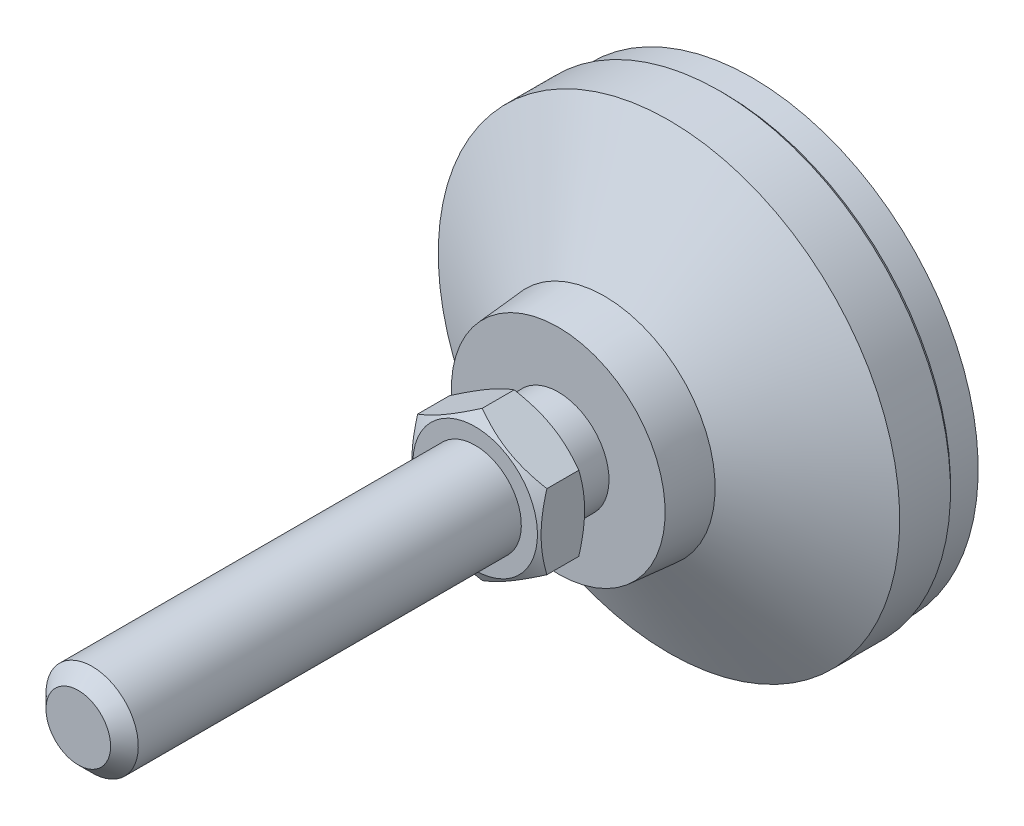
ISO-10303-21;
HEADER;
FILE_DESCRIPTION(('STEP AP214'),'2;1');
FILE_NAME('part.step','',(''),(''),'','','');
FILE_SCHEMA(('AUTOMOTIVE_DESIGN { 1 0 10303 214 1 1 1 1 }'));
ENDSEC;
DATA;
#1=APPLICATION_CONTEXT('core data for automotive mechanical design processes');
#2=APPLICATION_PROTOCOL_DEFINITION('international standard','automotive_design',2000,#1);
#3=PRODUCT_CONTEXT('',#1,'mechanical');
#4=PRODUCT('Part','Part','',(#3));
#5=PRODUCT_RELATED_PRODUCT_CATEGORY('part','',(#4));
#6=PRODUCT_DEFINITION_FORMATION('','',#4);
#7=PRODUCT_DEFINITION_CONTEXT('part definition',#1,'design');
#8=PRODUCT_DEFINITION('design','',#6,#7);
#9=PRODUCT_DEFINITION_SHAPE('','',#8);
#10=(LENGTH_UNIT() NAMED_UNIT(*) SI_UNIT(.MILLI.,.METRE.));
#11=(NAMED_UNIT(*) PLANE_ANGLE_UNIT() SI_UNIT($,.RADIAN.));
#12=(NAMED_UNIT(*) SI_UNIT($,.STERADIAN.) SOLID_ANGLE_UNIT());
#13=UNCERTAINTY_MEASURE_WITH_UNIT(LENGTH_MEASURE(1.E-05),#10,'distance_accuracy_value','');
#14=(GEOMETRIC_REPRESENTATION_CONTEXT(3) GLOBAL_UNCERTAINTY_ASSIGNED_CONTEXT((#13)) GLOBAL_UNIT_ASSIGNED_CONTEXT((#10,
#11,#12)) REPRESENTATION_CONTEXT('',''));
#15=CARTESIAN_POINT('',(0.,0.,0.));
#16=DIRECTION('',(0.,0.,1.));
#17=DIRECTION('',(1.,0.,0.));
#18=AXIS2_PLACEMENT_3D('',#15,#16,#17);
#19=CARTESIAN_POINT('',(0.,0.,2.));
#20=DIRECTION('',(0.,0.,-1.));
#21=DIRECTION('',(0.,1.,0.));
#22=AXIS2_PLACEMENT_3D('',#19,#20,#21);
#23=CYLINDRICAL_SURFACE('',#22,5.50000000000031);
#24=CARTESIAN_POINT('',(0.,0.,25.));
#25=DIRECTION('',(0.,0.,-1.));
#26=DIRECTION('',(0.,1.,0.));
#27=AXIS2_PLACEMENT_3D('',#24,#25,#26);
#28=CIRCLE('',#27,5.50000000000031);
#29=CARTESIAN_POINT('',(0.,5.50000000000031,25.));
#30=VERTEX_POINT('',#29);
#31=EDGE_CURVE('E106',#30,#30,#28,.T.);
#32=ORIENTED_EDGE('',*,*,#31,.T.);
#33=EDGE_LOOP('',(#32));
#34=FACE_BOUND('',#33,.T.);
#35=CARTESIAN_POINT('',(0.,0.,21.));
#36=DIRECTION('',(0.,0.,-1.));
#37=DIRECTION('',(0.,1.,0.));
#38=AXIS2_PLACEMENT_3D('',#35,#36,#37);
#39=CIRCLE('',#38,5.50000000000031);
#40=CARTESIAN_POINT('',(0.,5.50000000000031,21.));
#41=VERTEX_POINT('',#40);
#42=EDGE_CURVE('E93',#41,#41,#39,.T.);
#43=ORIENTED_EDGE('',*,*,#42,.F.);
#44=EDGE_LOOP('',(#43));
#45=FACE_BOUND('',#44,.T.);
#46=ADVANCED_FACE('F14',(#34,#45),#23,.T.);
#47=CARTESIAN_POINT('',(-5.50000000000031,0.,25.));
#48=DIRECTION('',(0.,0.,1.));
#49=DIRECTION('',(0.,-1.,0.));
#50=AXIS2_PLACEMENT_3D('',#47,#48,#49);
#51=PLANE('',#50);
#52=CARTESIAN_POINT('',(0.,0.,25.));
#53=DIRECTION('',(0.,0.,1.));
#54=DIRECTION('',(0.,-1.,0.));
#55=AXIS2_PLACEMENT_3D('',#52,#53,#54);
#56=CIRCLE('',#55,6.75);
#57=CARTESIAN_POINT('',(0.,-6.75,25.));
#58=VERTEX_POINT('',#57);
#59=EDGE_CURVE('E290',#58,#58,#56,.T.);
#60=ORIENTED_EDGE('',*,*,#59,.F.);
#61=EDGE_LOOP('',(#60));
#62=FACE_BOUND('',#61,.T.);
#63=ORIENTED_EDGE('',*,*,#31,.F.);
#64=EDGE_LOOP('',(#63));
#65=FACE_BOUND('',#64,.T.);
#66=ADVANCED_FACE('F148',(#62,#65),#51,.F.);
#67=CARTESIAN_POINT('',(0.,5.50000000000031,21.));
#68=DIRECTION('',(0.,0.,-1.));
#69=DIRECTION('',(0.,1.,0.));
#70=AXIS2_PLACEMENT_3D('',#67,#68,#69);
#71=PLANE('',#70);
#72=ORIENTED_EDGE('',*,*,#42,.T.);
#73=EDGE_LOOP('',(#72));
#74=FACE_BOUND('',#73,.T.);
#75=CARTESIAN_POINT('',(0.,0.,21.));
#76=DIRECTION('',(0.,0.,-1.));
#77=DIRECTION('',(0.,1.,0.));
#78=AXIS2_PLACEMENT_3D('',#75,#76,#77);
#79=CIRCLE('',#78,11.5833333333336);
#80=CARTESIAN_POINT('',(0.,11.5833333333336,21.));
#81=VERTEX_POINT('',#80);
#82=EDGE_CURVE('E88',#81,#81,#79,.T.);
#83=ORIENTED_EDGE('',*,*,#82,.F.);
#84=EDGE_LOOP('',(#83));
#85=FACE_BOUND('',#84,.T.);
#86=ADVANCED_FACE('F131',(#74,#85),#71,.F.);
#87=CARTESIAN_POINT('',(0.,0.,2.));
#88=DIRECTION('',(0.,0.,-1.));
#89=DIRECTION('',(0.,1.,0.));
#90=AXIS2_PLACEMENT_3D('',#87,#88,#89);
#91=CYLINDRICAL_SURFACE('',#90,25.);
#92=CARTESIAN_POINT('',(0.,0.,3.5));
#93=DIRECTION('',(0.,0.,1.));
#94=DIRECTION('',(0.,-1.,0.));
#95=AXIS2_PLACEMENT_3D('',#92,#93,#94);
#96=CIRCLE('',#95,25.);
#97=CARTESIAN_POINT('',(0.,-25.,3.5));
#98=VERTEX_POINT('',#97);
#99=EDGE_CURVE('E114',#98,#98,#96,.T.);
#100=ORIENTED_EDGE('',*,*,#99,.T.);
#101=EDGE_LOOP('',(#100));
#102=FACE_BOUND('',#101,.T.);
#103=CARTESIAN_POINT('',(0.,0.,9.));
#104=DIRECTION('',(0.,0.,-1.));
#105=DIRECTION('',(0.,1.,0.));
#106=AXIS2_PLACEMENT_3D('',#103,#104,#105);
#107=CIRCLE('',#106,25.);
#108=CARTESIAN_POINT('',(0.,25.,9.));
#109=VERTEX_POINT('',#108);
#110=EDGE_CURVE('E112',#109,#109,#107,.T.);
#111=ORIENTED_EDGE('',*,*,#110,.T.);
#112=EDGE_LOOP('',(#111));
#113=FACE_BOUND('',#112,.T.);
#114=ADVANCED_FACE('F127',(#102,#113),#91,.T.);
#115=CARTESIAN_POINT('',(0.,0.,16.));
#116=DIRECTION('',(0.,0.,-1.));
#117=DIRECTION('',(0.,1.,0.));
#118=AXIS2_PLACEMENT_3D('',#115,#116,#117);
#119=CONICAL_SURFACE('',#118,12.0000000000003,1.07685495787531);
#120=ORIENTED_EDGE('',*,*,#110,.F.);
#121=EDGE_LOOP('',(#120));
#122=FACE_BOUND('',#121,.T.);
#123=CARTESIAN_POINT('',(0.,0.,16.));
#124=DIRECTION('',(0.,0.,-1.));
#125=DIRECTION('',(0.,1.,0.));
#126=AXIS2_PLACEMENT_3D('',#123,#124,#125);
#127=CIRCLE('',#126,12.0000000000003);
#128=CARTESIAN_POINT('',(0.,12.0000000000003,16.));
#129=VERTEX_POINT('',#128);
#130=EDGE_CURVE('E109',#129,#129,#127,.T.);
#131=ORIENTED_EDGE('',*,*,#130,.T.);
#132=EDGE_LOOP('',(#131));
#133=FACE_BOUND('',#132,.T.);
#134=ADVANCED_FACE('F130',(#122,#133),#119,.T.);
#135=CARTESIAN_POINT('',(0.,0.,22.));
#136=DIRECTION('',(0.,0.,-1.));
#137=DIRECTION('',(0.,1.,0.));
#138=AXIS2_PLACEMENT_3D('',#135,#136,#137);
#139=CONICAL_SURFACE('',#138,11.5000000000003,0.0831412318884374);
#140=ORIENTED_EDGE('',*,*,#82,.T.);
#141=EDGE_LOOP('',(#140));
#142=FACE_BOUND('',#141,.T.);
#143=ORIENTED_EDGE('',*,*,#130,.F.);
#144=EDGE_LOOP('',(#143));
#145=FACE_BOUND('',#144,.T.);
#146=ADVANCED_FACE('F124',(#142,#145),#139,.T.);
#147=CARTESIAN_POINT('',(0.,0.,3.5));
#148=DIRECTION('',(0.,0.,1.));
#149=DIRECTION('',(0.,-1.,0.));
#150=AXIS2_PLACEMENT_3D('',#147,#148,#149);
#151=CONICAL_SURFACE('',#150,25.,0.785398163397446);
#152=CARTESIAN_POINT('',(0.,0.,3.));
#153=DIRECTION('',(0.,0.,1.));
#154=DIRECTION('',(0.,-1.,0.));
#155=AXIS2_PLACEMENT_3D('',#152,#153,#154);
#156=CIRCLE('',#155,24.5);
#157=CARTESIAN_POINT('',(0.,-24.5,3.));
#158=VERTEX_POINT('',#157);
#159=EDGE_CURVE('E28',#158,#158,#156,.F.);
#160=ORIENTED_EDGE('',*,*,#159,.F.);
#161=EDGE_LOOP('',(#160));
#162=FACE_BOUND('',#161,.T.);
#163=ORIENTED_EDGE('',*,*,#99,.F.);
#164=EDGE_LOOP('',(#163));
#165=FACE_BOUND('',#164,.T.);
#166=ADVANCED_FACE('F16',(#162,#165),#151,.T.);
#167=CARTESIAN_POINT('',(0.,0.,0.));
#168=DIRECTION('',(0.,0.,1.));
#169=DIRECTION('',(0.,-1.,0.));
#170=AXIS2_PLACEMENT_3D('',#167,#168,#169);
#171=CYLINDRICAL_SURFACE('',#170,24.5);
#172=CARTESIAN_POINT('',(0.,0.,0.));
#173=DIRECTION('',(0.,0.,-1.));
#174=DIRECTION('',(0.,1.,0.));
#175=AXIS2_PLACEMENT_3D('',#172,#173,#174);
#176=CIRCLE('',#175,24.5);
#177=CARTESIAN_POINT('',(0.,24.5,0.));
#178=VERTEX_POINT('',#177);
#179=EDGE_CURVE('E263',#178,#178,#176,.T.);
#180=ORIENTED_EDGE('',*,*,#179,.F.);
#181=EDGE_LOOP('',(#180));
#182=FACE_BOUND('',#181,.T.);
#183=ORIENTED_EDGE('',*,*,#159,.T.);
#184=EDGE_LOOP('',(#183));
#185=FACE_BOUND('',#184,.T.);
#186=ADVANCED_FACE('F120',(#182,#185),#171,.T.);
#187=CARTESIAN_POINT('',(0.,0.,0.));
#188=DIRECTION('',(0.,0.,-1.));
#189=DIRECTION('',(0.,1.,0.));
#190=AXIS2_PLACEMENT_3D('',#187,#188,#189);
#191=PLANE('',#190);
#192=ORIENTED_EDGE('',*,*,#179,.T.);
#193=EDGE_LOOP('',(#192));
#194=FACE_BOUND('',#193,.T.);
#195=ADVANCED_FACE('F205',(#194),#191,.T.);
#196=CARTESIAN_POINT('',(0.,0.,25.));
#197=DIRECTION('',(0.,0.,1.));
#198=DIRECTION('',(0.,-1.,0.));
#199=AXIS2_PLACEMENT_3D('',#196,#197,#198);
#200=CONICAL_SURFACE('',#199,6.75,1.0471975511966);
#201=CARTESIAN_POINT('',(0.000200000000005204,-8.08301923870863,25.7696190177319));
#202=CARTESIAN_POINT('',(-0.15366790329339,-7.99418356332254,25.7183374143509));
#203=CARTESIAN_POINT('',(-0.30810950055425,-7.90501666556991,25.669383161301));
#204=CARTESIAN_POINT('',(-0.618246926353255,-7.72595873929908,25.5767703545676));
#205=CARTESIAN_POINT('',(-0.773943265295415,-7.63606741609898,25.5331140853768));
#206=CARTESIAN_POINT('',(-1.24352516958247,-7.36495417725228,25.4109491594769));
#207=CARTESIAN_POINT('',(-1.5592643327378,-7.18266208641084,25.3414631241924));
#208=CARTESIAN_POINT('',(-2.03176224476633,-6.90986528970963,25.2599825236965));
#209=CARTESIAN_POINT('',(-2.18710922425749,-6.82017566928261,25.2367710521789));
#210=CARTESIAN_POINT('',(-2.49850511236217,-6.64039116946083,25.1978487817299));
#211=CARTESIAN_POINT('',(-2.65455395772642,-6.55029632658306,25.1821373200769));
#212=CARTESIAN_POINT('',(-2.96692267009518,-6.36995016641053,25.1586154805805));
#213=CARTESIAN_POINT('',(-3.12324202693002,-6.27969914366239,25.1507961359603));
#214=CARTESIAN_POINT('',(-3.43601650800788,-6.09911871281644,25.1432178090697));
#215=CARTESIAN_POINT('',(-3.59247162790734,-6.00878930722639,25.1434585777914));
#216=CARTESIAN_POINT('',(-4.02110687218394,-5.76131663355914,25.155197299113));
#217=CARTESIAN_POINT('',(-4.2931466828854,-5.60425437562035,25.1749033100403));
#218=CARTESIAN_POINT('',(-4.8354194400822,-5.29117305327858,25.2373910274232));
#219=CARTESIAN_POINT('',(-5.10565047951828,-5.13515508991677,25.2801940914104));
#220=CARTESIAN_POINT('',(-5.64901454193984,-4.82144370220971,25.3871892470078));
#221=CARTESIAN_POINT('',(-5.92207900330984,-4.66378986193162,25.4518346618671));
#222=CARTESIAN_POINT('',(-6.46413578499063,-4.35083323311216,25.5985536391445));
#223=CARTESIAN_POINT('',(-6.73313504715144,-4.1955264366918,25.680592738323));
#224=CARTESIAN_POINT('',(-7.0002,-4.04133641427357,25.7696190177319));
#225=B_SPLINE_CURVE_WITH_KNOTS('',3,(#201,#202,#203,#204,#205,#206,#207,#208,#209,#210,#211,
#212,#213,#214,#215,#216,#217,#218,#219,#220,#221,#222,#223,#224),.UNSPECIFIED.,.F.,.F.,(4,2,2,
2,2,2,2,2,2,2,2,4),(0.,0.554727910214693,1.10969417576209,2.2219327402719,2.76443041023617,
3.30688013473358,3.84871284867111,4.3905288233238,5.33376515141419,6.27787517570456,
7.2429241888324,8.20607866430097),.UNSPECIFIED.);
#226=CARTESIAN_POINT('',(0.,-8.08290376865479,25.7695523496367));
#227=VERTEX_POINT('',#226);
#228=CARTESIAN_POINT('',(-7.,-4.04145188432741,25.7695523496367));
#229=VERTEX_POINT('',#228);
#230=EDGE_CURVE('E73',#227,#229,#225,.T.);
#231=ORIENTED_EDGE('',*,*,#230,.T.);
#232=CARTESIAN_POINT('',(-7.,10.8542758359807,28.5597684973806));
#233=CARTESIAN_POINT('',(-7.,10.5485521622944,28.4114713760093));
#234=CARTESIAN_POINT('',(-7.,10.2421265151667,28.2645966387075));
#235=CARTESIAN_POINT('',(-7.,9.62749794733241,27.974491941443));
#236=CARTESIAN_POINT('',(-7.,9.31929475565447,27.8312625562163));
#237=CARTESIAN_POINT('',(-7.,8.69914909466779,27.5485276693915));
#238=CARTESIAN_POINT('',(-7.,8.38719540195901,27.4090466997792));
#239=CARTESIAN_POINT('',(-7.,7.7608063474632,27.1357948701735));
#240=CARTESIAN_POINT('',(-7.,7.44637110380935,27.0020237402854));
#241=CARTESIAN_POINT('',(-7.,6.80437652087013,26.7375205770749));
#242=CARTESIAN_POINT('',(-7.,6.47671975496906,26.6070237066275));
#243=CARTESIAN_POINT('',(-7.,5.8175730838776,26.3559101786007));
#244=CARTESIAN_POINT('',(-7.,5.48608275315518,26.2352946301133));
#245=CARTESIAN_POINT('',(-7.,4.81935849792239,26.0071116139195));
#246=CARTESIAN_POINT('',(-7.,4.48413371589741,25.8995177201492));
#247=CARTESIAN_POINT('',(-7.,3.80888756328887,25.7008301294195));
#248=CARTESIAN_POINT('',(-7.,3.46886774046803,25.609731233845));
#249=CARTESIAN_POINT('',(-7.,2.78566834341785,25.4488968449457));
#250=CARTESIAN_POINT('',(-7.,2.44251677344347,25.379045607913));
#251=CARTESIAN_POINT('',(-7.,1.92466579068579,25.2932294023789));
#252=CARTESIAN_POINT('',(-7.,1.75151547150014,25.2677829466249));
#253=CARTESIAN_POINT('',(-7.,1.40435470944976,25.2237094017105));
#254=CARTESIAN_POINT('',(-7.,1.23034435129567,25.2050816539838));
#255=CARTESIAN_POINT('',(-7.,0.883969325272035,25.1752501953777));
#256=CARTESIAN_POINT('',(-7.,0.711612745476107,25.1639529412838));
#257=CARTESIAN_POINT('',(-7.,0.366576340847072,25.1486569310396));
#258=CARTESIAN_POINT('',(-7.,0.193896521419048,25.144658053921));
#259=CARTESIAN_POINT('',(-7.,-0.151477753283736,25.1440541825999));
#260=CARTESIAN_POINT('',(-7.,-0.324172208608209,25.1474492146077));
#261=CARTESIAN_POINT('',(-7.,-0.669264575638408,25.1615502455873));
#262=CARTESIAN_POINT('',(-7.,-0.841662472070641,25.1722566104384));
#263=CARTESIAN_POINT('',(-7.,-1.25603087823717,25.2065503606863));
#264=CARTESIAN_POINT('',(-7.,-1.49772013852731,25.2336091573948));
#265=CARTESIAN_POINT('',(-7.,-1.97929249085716,25.3006197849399));
#266=CARTESIAN_POINT('',(-7.,-2.21917533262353,25.3405733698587));
#267=CARTESIAN_POINT('',(-7.,-2.93584677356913,25.4776567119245));
#268=CARTESIAN_POINT('',(-7.,-3.4093887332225,25.5919838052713));
#269=CARTESIAN_POINT('',(-7.,-4.11746158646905,25.7900867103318));
#270=CARTESIAN_POINT('',(-7.,-4.35566892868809,25.861476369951));
#271=CARTESIAN_POINT('',(-7.,-4.82976970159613,26.0116331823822));
#272=CARTESIAN_POINT('',(-7.,-5.06566311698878,26.0904003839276));
#273=CARTESIAN_POINT('',(-7.,-5.53521098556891,26.2540515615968));
#274=CARTESIAN_POINT('',(-7.,-5.76886615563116,26.3389334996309));
#275=CARTESIAN_POINT('',(-7.,-6.23424304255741,26.513819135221));
#276=CARTESIAN_POINT('',(-7.,-6.46596478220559,26.6038227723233));
#277=CARTESIAN_POINT('',(-7.,-7.01339528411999,26.8223061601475));
#278=CARTESIAN_POINT('',(-7.,-7.32835193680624,26.9526669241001));
#279=CARTESIAN_POINT('',(-7.,-7.95558350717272,27.2197063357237));
#280=CARTESIAN_POINT('',(-7.,-8.26785825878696,27.3563853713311));
#281=CARTESIAN_POINT('',(-7.,-8.89022045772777,27.6347899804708));
#282=CARTESIAN_POINT('',(-7.,-9.20030744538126,27.7765165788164));
#283=CARTESIAN_POINT('',(-7.,-9.818608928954,28.0640042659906));
#284=CARTESIAN_POINT('',(-7.,-10.1268233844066,28.2097654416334));
#285=CARTESIAN_POINT('',(-7.,-10.7420114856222,28.5047190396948));
#286=CARTESIAN_POINT('',(-7.,-11.0489834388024,28.6539149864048));
#287=CARTESIAN_POINT('',(-7.,-11.6616035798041,28.9550028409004));
#288=CARTESIAN_POINT('',(-7.,-11.9672517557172,29.1068947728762));
#289=CARTESIAN_POINT('',(-7.,-12.8824454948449,29.565855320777));
#290=CARTESIAN_POINT('',(-7.,-13.4903234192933,29.8762488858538));
#291=CARTESIAN_POINT('',(-7.,-14.6518364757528,30.4768875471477));
#292=CARTESIAN_POINT('',(-7.,-15.2057323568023,30.7666306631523));
#293=CARTESIAN_POINT('',(-7.,-16.3114681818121,31.3500583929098));
#294=CARTESIAN_POINT('',(-7.,-16.8633080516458,31.6437431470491));
#295=CARTESIAN_POINT('',(-7.,-17.9640037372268,32.2333737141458));
#296=CARTESIAN_POINT('',(-7.,-18.5128635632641,32.5293120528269));
#297=CARTESIAN_POINT('',(-7.,-19.6092692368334,33.1235416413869));
#298=CARTESIAN_POINT('',(-7.,-20.156815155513,33.4218327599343));
#299=CARTESIAN_POINT('',(-7.,-20.7038777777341,33.7210016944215));
#300=B_SPLINE_CURVE_WITH_KNOTS('',3,(#232,#233,#234,#235,#236,#237,#238,#239,#240,#241,#242,
#243,#244,#245,#246,#247,#248,#249,#250,#251,#252,#253,#254,#255,#256,#257,#258,#259,#260,#261,
#262,#263,#264,#265,#266,#267,#268,#269,#270,#271,#272,#273,#274,#275,#276,#277,#278,#279,#280,
#281,#282,#283,#284,#285,#286,#287,#288,#289,#290,#291,#292,#293,#294,#295,#296,#297,#298,#299),
.UNSPECIFIED.,.F.,.F.,(4,2,2,2,2,2,2,2,2,2,2,2,2,2,2,2,2,2,2,2,2,2,2,2,2,2,2,2,2,2,2,2,2,4),(0.,
1.01939020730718,2.03894015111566,3.06404327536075,4.08909789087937,5.14703636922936,
6.20509342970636,7.26096593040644,8.31650507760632,9.36618686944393,9.89110420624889,
10.4159708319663,10.9340006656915,11.4520219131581,11.9700449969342,12.488094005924,
13.217279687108,13.9465646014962,15.4059429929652,16.1519059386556,16.8978738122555,
17.6435941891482,18.3893057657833,19.4118194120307,20.4343959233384,21.4571812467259,
22.4799885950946,23.503896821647,24.5278142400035,26.5753720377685,28.4506592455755,
30.326013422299,32.1966862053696,34.0672552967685),.UNSPECIFIED.);
#301=CARTESIAN_POINT('',(-7.,4.04145188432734,25.7695523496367));
#302=VERTEX_POINT('',#301);
#303=EDGE_CURVE('E81',#229,#302,#300,.F.);
#304=ORIENTED_EDGE('',*,*,#303,.T.);
#305=CARTESIAN_POINT('',(-7.0002,4.0413364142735,25.7696190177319));
#306=CARTESIAN_POINT('',(-6.84633209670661,4.13017208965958,25.7183374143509));
#307=CARTESIAN_POINT('',(-6.69189049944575,4.21933898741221,25.669383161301));
#308=CARTESIAN_POINT('',(-6.38175307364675,4.39839691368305,25.5767703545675));
#309=CARTESIAN_POINT('',(-6.22605673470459,4.48828823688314,25.5331140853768));
#310=CARTESIAN_POINT('',(-5.75647483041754,4.75940147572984,25.4109491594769));
#311=CARTESIAN_POINT('',(-5.44073566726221,4.94169356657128,25.3414631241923));
#312=CARTESIAN_POINT('',(-4.96823775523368,5.21449036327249,25.2599825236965));
#313=CARTESIAN_POINT('',(-4.81289077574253,5.3041799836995,25.2367710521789));
#314=CARTESIAN_POINT('',(-4.50149488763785,5.48396448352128,25.1978487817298));
#315=CARTESIAN_POINT('',(-4.34544604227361,5.57405932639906,25.1821373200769));
#316=CARTESIAN_POINT('',(-4.03307732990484,5.75440548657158,25.1586154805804));
#317=CARTESIAN_POINT('',(-3.87675797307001,5.84465650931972,25.1507961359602));
#318=CARTESIAN_POINT('',(-3.56398349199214,6.02523694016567,25.1432178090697));
#319=CARTESIAN_POINT('',(-3.40752837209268,6.11556634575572,25.1434585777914));
#320=CARTESIAN_POINT('',(-2.97889312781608,6.36303901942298,25.155197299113));
#321=CARTESIAN_POINT('',(-2.70685331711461,6.52010127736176,25.1749033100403));
#322=CARTESIAN_POINT('',(-2.16458055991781,6.83318259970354,25.2373910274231));
#323=CARTESIAN_POINT('',(-1.89434952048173,6.98920056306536,25.2801940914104));
#324=CARTESIAN_POINT('',(-1.35098545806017,7.30291195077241,25.3871892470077));
#325=CARTESIAN_POINT('',(-1.07792099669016,7.4605657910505,25.451834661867));
#326=CARTESIAN_POINT('',(-0.535864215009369,7.77352241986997,25.5985536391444));
#327=CARTESIAN_POINT('',(-0.266864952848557,7.92882921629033,25.680592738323));
#328=CARTESIAN_POINT('',(0.000200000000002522,8.08301923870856,25.7696190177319));
#329=B_SPLINE_CURVE_WITH_KNOTS('',3,(#305,#306,#307,#308,#309,#310,#311,#312,#313,#314,#315,
#316,#317,#318,#319,#320,#321,#322,#323,#324,#325,#326,#327,#328),.UNSPECIFIED.,.F.,.F.,(4,2,2,
2,2,2,2,2,2,2,2,4),(0.,0.554727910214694,1.10969417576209,2.22193274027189,2.76443041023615,
3.30688013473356,3.84871284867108,4.39052882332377,5.33376515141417,6.27787517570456,
7.2429241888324,8.20607866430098),.UNSPECIFIED.);
#330=CARTESIAN_POINT('',(0.,8.08290376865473,25.7695523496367));
#331=VERTEX_POINT('',#330);
#332=EDGE_CURVE('E226',#302,#331,#329,.T.);
#333=ORIENTED_EDGE('',*,*,#332,.T.);
#334=CARTESIAN_POINT('',(-0.000199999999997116,8.08301923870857,25.7696190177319));
#335=CARTESIAN_POINT('',(0.153667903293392,7.99418356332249,25.7183374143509));
#336=CARTESIAN_POINT('',(0.308109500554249,7.90501666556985,25.669383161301));
#337=CARTESIAN_POINT('',(0.618246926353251,7.72595873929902,25.5767703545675));
#338=CARTESIAN_POINT('',(0.773943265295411,7.63606741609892,25.5331140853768));
#339=CARTESIAN_POINT('',(1.24352516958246,7.36495417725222,25.4109491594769));
#340=CARTESIAN_POINT('',(1.55926433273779,7.18266208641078,25.3414631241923));
#341=CARTESIAN_POINT('',(2.03176224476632,6.90986528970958,25.2599825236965));
#342=CARTESIAN_POINT('',(2.18710922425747,6.82017566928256,25.2367710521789));
#343=CARTESIAN_POINT('',(2.49850511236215,6.64039116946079,25.1978487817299));
#344=CARTESIAN_POINT('',(2.65455395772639,6.55029632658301,25.1821373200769));
#345=CARTESIAN_POINT('',(2.96692267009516,6.36995016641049,25.1586154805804));
#346=CARTESIAN_POINT('',(3.12324202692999,6.27969914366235,25.1507961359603));
#347=CARTESIAN_POINT('',(3.43601650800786,6.0991187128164,25.1432178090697));
#348=CARTESIAN_POINT('',(3.59247162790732,6.00878930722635,25.1434585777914));
#349=CARTESIAN_POINT('',(4.02110687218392,5.76131663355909,25.155197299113));
#350=CARTESIAN_POINT('',(4.29314668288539,5.60425437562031,25.1749033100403));
#351=CARTESIAN_POINT('',(4.83541944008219,5.29117305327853,25.2373910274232));
#352=CARTESIAN_POINT('',(5.10565047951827,5.13515508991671,25.2801940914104));
#353=CARTESIAN_POINT('',(5.64901454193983,4.82144370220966,25.3871892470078));
#354=CARTESIAN_POINT('',(5.92207900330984,4.66378986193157,25.4518346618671));
#355=CARTESIAN_POINT('',(6.46413578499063,4.3508332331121,25.5985536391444));
#356=CARTESIAN_POINT('',(6.73313504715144,4.19552643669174,25.680592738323));
#357=CARTESIAN_POINT('',(7.0002,4.04133641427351,25.7696190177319));
#358=B_SPLINE_CURVE_WITH_KNOTS('',3,(#334,#335,#336,#337,#338,#339,#340,#341,#342,#343,#344,
#345,#346,#347,#348,#349,#350,#351,#352,#353,#354,#355,#356,#357),.UNSPECIFIED.,.F.,.F.,(4,2,2,
2,2,2,2,2,2,2,2,4),(0.,0.554727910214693,1.10969417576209,2.22193274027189,2.76443041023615,
3.30688013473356,3.84871284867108,4.39052882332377,5.33376515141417,6.27787517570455,
7.2429241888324,8.20607866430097),.UNSPECIFIED.);
#359=CARTESIAN_POINT('',(7.,4.04145188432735,25.7695523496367));
#360=VERTEX_POINT('',#359);
#361=EDGE_CURVE('E220',#331,#360,#358,.T.);
#362=ORIENTED_EDGE('',*,*,#361,.T.);
#363=CARTESIAN_POINT('',(7.,10.8542758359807,28.5597684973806));
#364=CARTESIAN_POINT('',(7.,10.5485521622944,28.4114713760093));
#365=CARTESIAN_POINT('',(7.,10.2421265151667,28.2645966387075));
#366=CARTESIAN_POINT('',(7.,9.62749794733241,27.974491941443));
#367=CARTESIAN_POINT('',(7.,9.31929475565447,27.8312625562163));
#368=CARTESIAN_POINT('',(7.,8.69914909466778,27.5485276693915));
#369=CARTESIAN_POINT('',(7.,8.387195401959,27.4090466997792));
#370=CARTESIAN_POINT('',(7.,7.7608063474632,27.1357948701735));
#371=CARTESIAN_POINT('',(7.,7.44637110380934,27.0020237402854));
#372=CARTESIAN_POINT('',(7.,6.80437652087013,26.7375205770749));
#373=CARTESIAN_POINT('',(7.,6.47671975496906,26.6070237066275));
#374=CARTESIAN_POINT('',(7.,5.8175730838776,26.3559101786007));
#375=CARTESIAN_POINT('',(7.,5.48608275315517,26.2352946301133));
#376=CARTESIAN_POINT('',(7.,4.81935849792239,26.0071116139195));
#377=CARTESIAN_POINT('',(7.,4.48413371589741,25.8995177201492));
#378=CARTESIAN_POINT('',(7.,3.80888756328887,25.7008301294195));
#379=CARTESIAN_POINT('',(7.,3.46886774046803,25.609731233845));
#380=CARTESIAN_POINT('',(7.,2.78566834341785,25.4488968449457));
#381=CARTESIAN_POINT('',(7.,2.44251677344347,25.379045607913));
#382=CARTESIAN_POINT('',(7.,1.9246657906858,25.2932294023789));
#383=CARTESIAN_POINT('',(7.,1.75151547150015,25.2677829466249));
#384=CARTESIAN_POINT('',(7.,1.40435470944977,25.2237094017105));
#385=CARTESIAN_POINT('',(7.,1.23034435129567,25.2050816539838));
#386=CARTESIAN_POINT('',(7.,0.883969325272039,25.1752501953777));
#387=CARTESIAN_POINT('',(7.,0.711612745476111,25.1639529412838));
#388=CARTESIAN_POINT('',(7.,0.366576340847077,25.1486569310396));
#389=CARTESIAN_POINT('',(7.,0.193896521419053,25.144658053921));
#390=CARTESIAN_POINT('',(7.,-0.151477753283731,25.1440541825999));
#391=CARTESIAN_POINT('',(7.,-0.324172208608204,25.1474492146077));
#392=CARTESIAN_POINT('',(7.,-0.669264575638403,25.1615502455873));
#393=CARTESIAN_POINT('',(7.,-0.841662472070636,25.1722566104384));
#394=CARTESIAN_POINT('',(7.,-1.25603087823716,25.2065503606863));
#395=CARTESIAN_POINT('',(7.,-1.4977201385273,25.2336091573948));
#396=CARTESIAN_POINT('',(7.,-1.97929249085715,25.3006197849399));
#397=CARTESIAN_POINT('',(7.,-2.21917533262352,25.3405733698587));
#398=CARTESIAN_POINT('',(7.,-2.93584677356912,25.4776567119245));
#399=CARTESIAN_POINT('',(7.,-3.40938873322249,25.5919838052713));
#400=CARTESIAN_POINT('',(7.,-4.11746158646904,25.7900867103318));
#401=CARTESIAN_POINT('',(7.,-4.35566892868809,25.861476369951));
#402=CARTESIAN_POINT('',(7.,-4.82976970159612,26.0116331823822));
#403=CARTESIAN_POINT('',(7.,-5.06566311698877,26.0904003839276));
#404=CARTESIAN_POINT('',(7.,-5.5352109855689,26.2540515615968));
#405=CARTESIAN_POINT('',(7.,-5.76886615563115,26.3389334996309));
#406=CARTESIAN_POINT('',(7.,-6.2342430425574,26.513819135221));
#407=CARTESIAN_POINT('',(7.,-6.46596478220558,26.6038227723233));
#408=CARTESIAN_POINT('',(7.,-7.01339528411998,26.8223061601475));
#409=CARTESIAN_POINT('',(7.,-7.32835193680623,26.9526669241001));
#410=CARTESIAN_POINT('',(7.,-7.95558350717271,27.2197063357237));
#411=CARTESIAN_POINT('',(7.,-8.26785825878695,27.3563853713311));
#412=CARTESIAN_POINT('',(7.,-8.89022045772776,27.6347899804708));
#413=CARTESIAN_POINT('',(7.,-9.20030744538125,27.7765165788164));
#414=CARTESIAN_POINT('',(7.,-9.81860892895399,28.0640042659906));
#415=CARTESIAN_POINT('',(7.,-10.1268233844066,28.2097654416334));
#416=CARTESIAN_POINT('',(7.,-10.7420114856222,28.5047190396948));
#417=CARTESIAN_POINT('',(7.,-11.0489834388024,28.6539149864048));
#418=CARTESIAN_POINT('',(7.,-11.6616035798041,28.9550028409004));
#419=CARTESIAN_POINT('',(7.,-11.9672517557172,29.1068947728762));
#420=CARTESIAN_POINT('',(7.,-12.8824454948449,29.565855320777));
#421=CARTESIAN_POINT('',(7.,-13.4903234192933,29.8762488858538));
#422=CARTESIAN_POINT('',(7.,-14.6518364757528,30.4768875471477));
#423=CARTESIAN_POINT('',(7.,-15.2057323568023,30.7666306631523));
#424=CARTESIAN_POINT('',(7.,-16.3114681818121,31.3500583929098));
#425=CARTESIAN_POINT('',(7.,-16.8633080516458,31.6437431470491));
#426=CARTESIAN_POINT('',(7.,-17.9640037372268,32.2333737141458));
#427=CARTESIAN_POINT('',(7.,-18.5128635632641,32.5293120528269));
#428=CARTESIAN_POINT('',(7.,-19.6092692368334,33.1235416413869));
#429=CARTESIAN_POINT('',(7.,-20.156815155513,33.4218327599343));
#430=CARTESIAN_POINT('',(7.,-20.7038777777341,33.7210016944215));
#431=B_SPLINE_CURVE_WITH_KNOTS('',3,(#363,#364,#365,#366,#367,#368,#369,#370,#371,#372,#373,
#374,#375,#376,#377,#378,#379,#380,#381,#382,#383,#384,#385,#386,#387,#388,#389,#390,#391,#392,
#393,#394,#395,#396,#397,#398,#399,#400,#401,#402,#403,#404,#405,#406,#407,#408,#409,#410,#411,
#412,#413,#414,#415,#416,#417,#418,#419,#420,#421,#422,#423,#424,#425,#426,#427,#428,#429,#430),
.UNSPECIFIED.,.F.,.F.,(4,2,2,2,2,2,2,2,2,2,2,2,2,2,2,2,2,2,2,2,2,2,2,2,2,2,2,2,2,2,2,2,2,4),(0.,
1.01939020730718,2.03894015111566,3.06404327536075,4.08909789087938,5.14703636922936,
6.20509342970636,7.26096593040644,8.31650507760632,9.36618686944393,9.89110420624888,
10.4159708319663,10.9340006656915,11.4520219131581,11.9700449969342,12.4880940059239,
13.217279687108,13.9465646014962,15.4059429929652,16.1519059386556,16.8978738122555,
17.6435941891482,18.3893057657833,19.4118194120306,20.4343959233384,21.4571812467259,
22.4799885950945,23.503896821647,24.5278142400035,26.5753720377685,28.4506592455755,
30.326013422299,32.1966862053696,34.0672552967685),.UNSPECIFIED.);
#432=CARTESIAN_POINT('',(7.,-4.04145188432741,25.7695523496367));
#433=VERTEX_POINT('',#432);
#434=EDGE_CURVE('E34',#360,#433,#431,.T.);
#435=ORIENTED_EDGE('',*,*,#434,.T.);
#436=CARTESIAN_POINT('',(7.0002,-4.04133641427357,25.7696190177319));
#437=CARTESIAN_POINT('',(6.84633209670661,-4.13017208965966,25.7183374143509));
#438=CARTESIAN_POINT('',(6.69189049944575,-4.21933898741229,25.669383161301));
#439=CARTESIAN_POINT('',(6.38175307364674,-4.39839691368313,25.5767703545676));
#440=CARTESIAN_POINT('',(6.22605673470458,-4.48828823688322,25.5331140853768));
#441=CARTESIAN_POINT('',(5.75647483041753,-4.75940147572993,25.4109491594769));
#442=CARTESIAN_POINT('',(5.44073566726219,-4.94169356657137,25.3414631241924));
#443=CARTESIAN_POINT('',(4.96823775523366,-5.21449036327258,25.2599825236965));
#444=CARTESIAN_POINT('',(4.81289077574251,-5.30417998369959,25.2367710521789));
#445=CARTESIAN_POINT('',(4.50149488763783,-5.48396448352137,25.1978487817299));
#446=CARTESIAN_POINT('',(4.34544604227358,-5.57405932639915,25.1821373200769));
#447=CARTESIAN_POINT('',(4.03307732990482,-5.75440548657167,25.1586154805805));
#448=CARTESIAN_POINT('',(3.87675797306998,-5.84465650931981,25.1507961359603));
#449=CARTESIAN_POINT('',(3.56398349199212,-6.02523694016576,25.1432178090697));
#450=CARTESIAN_POINT('',(3.40752837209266,-6.11556634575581,25.1434585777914));
#451=CARTESIAN_POINT('',(2.97889312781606,-6.36303901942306,25.155197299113));
#452=CARTESIAN_POINT('',(2.7068533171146,-6.52010127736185,25.1749033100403));
#453=CARTESIAN_POINT('',(2.16458055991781,-6.83318259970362,25.2373910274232));
#454=CARTESIAN_POINT('',(1.89434952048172,-6.98920056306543,25.2801940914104));
#455=CARTESIAN_POINT('',(1.35098545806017,-7.30291195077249,25.3871892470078));
#456=CARTESIAN_POINT('',(1.07792099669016,-7.46056579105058,25.4518346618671));
#457=CARTESIAN_POINT('',(0.535864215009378,-7.77352241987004,25.5985536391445));
#458=CARTESIAN_POINT('',(0.266864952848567,-7.9288292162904,25.680592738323));
#459=CARTESIAN_POINT('',(-0.000199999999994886,-8.08301923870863,25.7696190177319));
#460=B_SPLINE_CURVE_WITH_KNOTS('',3,(#436,#437,#438,#439,#440,#441,#442,#443,#444,#445,#446,
#447,#448,#449,#450,#451,#452,#453,#454,#455,#456,#457,#458,#459),.UNSPECIFIED.,.F.,.F.,(4,2,2,
2,2,2,2,2,2,2,2,4),(0.,0.554727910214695,1.10969417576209,2.2219327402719,2.76443041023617,
3.30688013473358,3.8487128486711,4.39052882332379,5.33376515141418,6.27787517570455,
7.24292418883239,8.20607866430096),.UNSPECIFIED.);
#461=EDGE_CURVE('E9',#433,#227,#460,.T.);
#462=ORIENTED_EDGE('',*,*,#461,.T.);
#463=EDGE_LOOP('',(#231,#304,#333,#362,#435,#462));
#464=FACE_BOUND('',#463,.T.);
#465=ORIENTED_EDGE('',*,*,#59,.T.);
#466=EDGE_LOOP('',(#465));
#467=FACE_BOUND('',#466,.T.);
#468=ADVANCED_FACE('F71',(#464,#467),#200,.T.);
#469=CARTESIAN_POINT('',(-3.50000000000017,0.,73.));
#470=DIRECTION('',(0.,0.,-1.));
#471=DIRECTION('',(0.,1.,0.));
#472=AXIS2_PLACEMENT_3D('',#469,#470,#471);
#473=PLANE('',#472);
#474=CARTESIAN_POINT('',(0.,0.,73.));
#475=DIRECTION('',(0.,0.,-1.));
#476=DIRECTION('',(0.,1.,0.));
#477=AXIS2_PLACEMENT_3D('',#474,#475,#476);
#478=CIRCLE('',#477,3.50000000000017);
#479=CARTESIAN_POINT('',(0.,3.50000000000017,73.));
#480=VERTEX_POINT('',#479);
#481=EDGE_CURVE('E97',#480,#480,#478,.T.);
#482=ORIENTED_EDGE('',*,*,#481,.F.);
#483=EDGE_LOOP('',(#482));
#484=FACE_BOUND('',#483,.T.);
#485=ADVANCED_FACE('F170',(#484),#473,.F.);
#486=CARTESIAN_POINT('',(0.,0.,73.));
#487=DIRECTION('',(0.,0.,-1.));
#488=DIRECTION('',(0.,1.,0.));
#489=AXIS2_PLACEMENT_3D('',#486,#487,#488);
#490=CONICAL_SURFACE('',#489,3.50000000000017,0.785398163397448);
#491=CARTESIAN_POINT('',(0.,0.,71.5));
#492=DIRECTION('',(0.,0.,-1.));
#493=DIRECTION('',(0.,1.,0.));
#494=AXIS2_PLACEMENT_3D('',#491,#492,#493);
#495=CIRCLE('',#494,5.00000000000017);
#496=CARTESIAN_POINT('',(0.,5.00000000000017,71.5));
#497=VERTEX_POINT('',#496);
#498=EDGE_CURVE('E100',#497,#497,#495,.T.);
#499=ORIENTED_EDGE('',*,*,#498,.F.);
#500=EDGE_LOOP('',(#499));
#501=FACE_BOUND('',#500,.T.);
#502=ORIENTED_EDGE('',*,*,#481,.T.);
#503=EDGE_LOOP('',(#502));
#504=FACE_BOUND('',#503,.T.);
#505=ADVANCED_FACE('F166',(#501,#504),#490,.T.);
#506=CARTESIAN_POINT('',(0.,0.,2.));
#507=DIRECTION('',(0.,0.,-1.));
#508=DIRECTION('',(0.,1.,0.));
#509=AXIS2_PLACEMENT_3D('',#506,#507,#508);
#510=CYLINDRICAL_SURFACE('',#509,5.00000000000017);
#511=CARTESIAN_POINT('',(0.,0.,30.));
#512=DIRECTION('',(0.,0.,-1.));
#513=DIRECTION('',(0.,1.,0.));
#514=AXIS2_PLACEMENT_3D('',#511,#512,#513);
#515=CIRCLE('',#514,5.00000000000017);
#516=CARTESIAN_POINT('',(0.,5.00000000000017,30.));
#517=VERTEX_POINT('',#516);
#518=EDGE_CURVE('E103',#517,#517,#515,.T.);
#519=ORIENTED_EDGE('',*,*,#518,.F.);
#520=EDGE_LOOP('',(#519));
#521=FACE_BOUND('',#520,.T.);
#522=ORIENTED_EDGE('',*,*,#498,.T.);
#523=EDGE_LOOP('',(#522));
#524=FACE_BOUND('',#523,.T.);
#525=ADVANCED_FACE('F162',(#521,#524),#510,.T.);
#526=CARTESIAN_POINT('',(-5.00000000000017,0.,30.));
#527=DIRECTION('',(0.,0.,-1.));
#528=DIRECTION('',(0.,1.,0.));
#529=AXIS2_PLACEMENT_3D('',#526,#527,#528);
#530=PLANE('',#529);
#531=CARTESIAN_POINT('',(0.,0.,30.));
#532=DIRECTION('',(0.,0.,1.));
#533=DIRECTION('',(0.,-1.,0.));
#534=AXIS2_PLACEMENT_3D('',#531,#532,#533);
#535=CIRCLE('',#534,6.75);
#536=CARTESIAN_POINT('',(0.,-6.75,30.));
#537=VERTEX_POINT('',#536);
#538=EDGE_CURVE('E80',#537,#537,#535,.T.);
#539=ORIENTED_EDGE('',*,*,#538,.T.);
#540=EDGE_LOOP('',(#539));
#541=FACE_BOUND('',#540,.T.);
#542=ORIENTED_EDGE('',*,*,#518,.T.);
#543=EDGE_LOOP('',(#542));
#544=FACE_BOUND('',#543,.T.);
#545=ADVANCED_FACE('F158',(#541,#544),#530,.F.);
#546=CARTESIAN_POINT('',(0.,0.,28.1116568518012));
#547=DIRECTION('',(0.,0.,-1.));
#548=DIRECTION('',(0.,1.,0.));
#549=AXIS2_PLACEMENT_3D('',#546,#547,#548);
#550=CONICAL_SURFACE('',#549,10.0207062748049,1.0471975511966);
#551=CARTESIAN_POINT('',(-7.0002,-4.04133641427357,29.2303809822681));
#552=CARTESIAN_POINT('',(-6.84633209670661,-4.13017208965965,29.2816625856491));
#553=CARTESIAN_POINT('',(-6.69189049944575,-4.21933898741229,29.330616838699));
#554=CARTESIAN_POINT('',(-6.38175307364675,-4.39839691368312,29.4232296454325));
#555=CARTESIAN_POINT('',(-6.22605673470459,-4.48828823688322,29.4668859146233));
#556=CARTESIAN_POINT('',(-5.75647483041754,-4.75940147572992,29.5890508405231));
#557=CARTESIAN_POINT('',(-5.4407356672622,-4.94169356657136,29.6585368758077));
#558=CARTESIAN_POINT('',(-4.96823775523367,-5.21449036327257,29.7400174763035));
#559=CARTESIAN_POINT('',(-4.81289077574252,-5.30417998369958,29.7632289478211));
#560=CARTESIAN_POINT('',(-4.50149488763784,-5.48396448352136,29.8021512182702));
#561=CARTESIAN_POINT('',(-4.34544604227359,-5.57405932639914,29.8178626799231));
#562=CARTESIAN_POINT('',(-4.03307732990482,-5.75440548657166,29.8413845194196));
#563=CARTESIAN_POINT('',(-3.87675797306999,-5.8446565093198,29.8492038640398));
#564=CARTESIAN_POINT('',(-3.56398349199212,-6.02523694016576,29.8567821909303));
#565=CARTESIAN_POINT('',(-3.40752837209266,-6.11556634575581,29.8565414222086));
#566=CARTESIAN_POINT('',(-2.97889312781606,-6.36303901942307,29.844802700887));
#567=CARTESIAN_POINT('',(-2.70685331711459,-6.52010127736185,29.8250966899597));
#568=CARTESIAN_POINT('',(-2.16458055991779,-6.83318259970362,29.7626089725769));
#569=CARTESIAN_POINT('',(-1.89434952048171,-6.98920056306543,29.7198059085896));
#570=CARTESIAN_POINT('',(-1.35098545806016,-7.30291195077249,29.6128107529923));
#571=CARTESIAN_POINT('',(-1.07792099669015,-7.46056579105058,29.5481653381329));
#572=CARTESIAN_POINT('',(-0.535864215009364,-7.77352241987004,29.4014463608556));
#573=CARTESIAN_POINT('',(-0.266864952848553,-7.9288292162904,29.319407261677));
#574=CARTESIAN_POINT('',(0.000200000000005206,-8.08301923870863,29.2303809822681));
#575=B_SPLINE_CURVE_WITH_KNOTS('',3,(#551,#552,#553,#554,#555,#556,#557,#558,#559,#560,#561,
#562,#563,#564,#565,#566,#567,#568,#569,#570,#571,#572,#573,#574),.UNSPECIFIED.,.F.,.F.,(4,2,2,
2,2,2,2,2,2,2,2,4),(0.,0.554727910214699,1.1096941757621,2.2219327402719,2.76443041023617,
3.30688013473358,3.84871284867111,4.3905288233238,5.3337651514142,6.27787517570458,
7.24292418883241,8.20607866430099),.UNSPECIFIED.);
#576=CARTESIAN_POINT('',(-7.,-4.04145188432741,29.2304476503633));
#577=VERTEX_POINT('',#576);
#578=CARTESIAN_POINT('',(0.,-8.08290376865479,29.2304476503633));
#579=VERTEX_POINT('',#578);
#580=EDGE_CURVE('E182',#577,#579,#575,.T.);
#581=ORIENTED_EDGE('',*,*,#580,.T.);
#582=CARTESIAN_POINT('',(-0.000199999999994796,-8.08301923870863,29.2303809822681));
#583=CARTESIAN_POINT('',(0.153667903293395,-7.99418356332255,29.2816625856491));
#584=CARTESIAN_POINT('',(0.308109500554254,-7.90501666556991,29.330616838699));
#585=CARTESIAN_POINT('',(0.618246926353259,-7.72595873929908,29.4232296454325));
#586=CARTESIAN_POINT('',(0.773943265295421,-7.63606741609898,29.4668859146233));
#587=CARTESIAN_POINT('',(1.24352516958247,-7.36495417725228,29.5890508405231));
#588=CARTESIAN_POINT('',(1.55926433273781,-7.18266208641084,29.6585368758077));
#589=CARTESIAN_POINT('',(2.03176224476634,-6.90986528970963,29.7400174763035));
#590=CARTESIAN_POINT('',(2.1871092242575,-6.82017566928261,29.7632289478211));
#591=CARTESIAN_POINT('',(2.49850511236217,-6.64039116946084,29.8021512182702));
#592=CARTESIAN_POINT('',(2.65455395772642,-6.55029632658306,29.8178626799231));
#593=CARTESIAN_POINT('',(2.96692267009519,-6.36995016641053,29.8413845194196));
#594=CARTESIAN_POINT('',(3.12324202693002,-6.27969914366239,29.8492038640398));
#595=CARTESIAN_POINT('',(3.43601650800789,-6.09911871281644,29.8567821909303));
#596=CARTESIAN_POINT('',(3.59247162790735,-6.00878930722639,29.8565414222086));
#597=CARTESIAN_POINT('',(4.02110687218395,-5.76131663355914,29.844802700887));
#598=CARTESIAN_POINT('',(4.29314668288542,-5.60425437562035,29.8250966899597));
#599=CARTESIAN_POINT('',(4.83541944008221,-5.29117305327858,29.7626089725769));
#600=CARTESIAN_POINT('',(5.10565047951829,-5.13515508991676,29.7198059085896));
#601=CARTESIAN_POINT('',(5.64901454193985,-4.82144370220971,29.6128107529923));
#602=CARTESIAN_POINT('',(5.92207900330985,-4.66378986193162,29.548165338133));
#603=CARTESIAN_POINT('',(6.46413578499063,-4.35083323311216,29.4014463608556));
#604=CARTESIAN_POINT('',(6.73313504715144,-4.1955264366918,29.3194072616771));
#605=CARTESIAN_POINT('',(7.0002,-4.04133641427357,29.2303809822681));
#606=B_SPLINE_CURVE_WITH_KNOTS('',3,(#582,#583,#584,#585,#586,#587,#588,#589,#590,#591,#592,
#593,#594,#595,#596,#597,#598,#599,#600,#601,#602,#603,#604,#605),.UNSPECIFIED.,.F.,.F.,(4,2,2,
2,2,2,2,2,2,2,2,4),(0.,0.554727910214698,1.1096941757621,2.22193274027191,2.76443041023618,
3.30688013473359,3.84871284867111,4.39052882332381,5.3337651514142,6.27787517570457,
7.24292418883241,8.20607866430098),.UNSPECIFIED.);
#607=CARTESIAN_POINT('',(7.,-4.04145188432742,29.2304476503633));
#608=VERTEX_POINT('',#607);
#609=EDGE_CURVE('E86',#579,#608,#606,.T.);
#610=ORIENTED_EDGE('',*,*,#609,.T.);
#611=CARTESIAN_POINT('',(7.,10.8542758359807,26.4402315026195));
#612=CARTESIAN_POINT('',(7.,10.5485521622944,26.5885286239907));
#613=CARTESIAN_POINT('',(7.,10.2421265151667,26.7354033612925));
#614=CARTESIAN_POINT('',(7.,9.62749794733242,27.025508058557));
#615=CARTESIAN_POINT('',(7.,9.31929475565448,27.1687374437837));
#616=CARTESIAN_POINT('',(7.,8.6991490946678,27.4514723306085));
#617=CARTESIAN_POINT('',(7.,8.38719540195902,27.5909533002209));
#618=CARTESIAN_POINT('',(7.,7.76080634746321,27.8642051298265));
#619=CARTESIAN_POINT('',(7.,7.44637110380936,27.9979762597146));
#620=CARTESIAN_POINT('',(7.,6.80437652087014,28.2624794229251));
#621=CARTESIAN_POINT('',(7.,6.47671975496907,28.3929762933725));
#622=CARTESIAN_POINT('',(7.,5.81757308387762,28.6440898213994));
#623=CARTESIAN_POINT('',(7.,5.48608275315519,28.7647053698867));
#624=CARTESIAN_POINT('',(7.,4.81935849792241,28.9928883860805));
#625=CARTESIAN_POINT('',(7.,4.48413371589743,29.1004822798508));
#626=CARTESIAN_POINT('',(7.,3.80888756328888,29.2991698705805));
#627=CARTESIAN_POINT('',(7.,3.46886774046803,29.390268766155));
#628=CARTESIAN_POINT('',(7.,2.78566834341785,29.5511031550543));
#629=CARTESIAN_POINT('',(7.,2.44251677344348,29.620954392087));
#630=CARTESIAN_POINT('',(7.,1.9246657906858,29.7067705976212));
#631=CARTESIAN_POINT('',(7.,1.75151547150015,29.7322170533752));
#632=CARTESIAN_POINT('',(7.,1.40435470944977,29.7762905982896));
#633=CARTESIAN_POINT('',(7.,1.23034435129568,29.7949183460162));
#634=CARTESIAN_POINT('',(7.,0.883969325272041,29.8247498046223));
#635=CARTESIAN_POINT('',(7.,0.711612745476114,29.8360470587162));
#636=CARTESIAN_POINT('',(7.,0.366576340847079,29.8513430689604));
#637=CARTESIAN_POINT('',(7.,0.193896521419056,29.8553419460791));
#638=CARTESIAN_POINT('',(7.,-0.151477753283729,29.8559458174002));
#639=CARTESIAN_POINT('',(7.,-0.324172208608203,29.8525507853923));
#640=CARTESIAN_POINT('',(7.,-0.669264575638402,29.8384497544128));
#641=CARTESIAN_POINT('',(7.,-0.841662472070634,29.8277433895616));
#642=CARTESIAN_POINT('',(7.,-1.25603087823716,29.7934496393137));
#643=CARTESIAN_POINT('',(7.,-1.49772013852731,29.7663908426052));
#644=CARTESIAN_POINT('',(7.,-1.97929249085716,29.6993802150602));
#645=CARTESIAN_POINT('',(7.,-2.21917533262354,29.6594266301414));
#646=CARTESIAN_POINT('',(7.,-2.93584677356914,29.5223432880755));
#647=CARTESIAN_POINT('',(7.,-3.40938873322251,29.4080161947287));
#648=CARTESIAN_POINT('',(7.,-4.11746158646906,29.2099132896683));
#649=CARTESIAN_POINT('',(7.,-4.35566892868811,29.1385236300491));
#650=CARTESIAN_POINT('',(7.,-4.82976970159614,28.9883668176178));
#651=CARTESIAN_POINT('',(7.,-5.0656631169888,28.9095996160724));
#652=CARTESIAN_POINT('',(7.,-5.53521098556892,28.7459484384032));
#653=CARTESIAN_POINT('',(7.,-5.76886615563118,28.6610665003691));
#654=CARTESIAN_POINT('',(7.,-6.23424304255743,28.486180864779));
#655=CARTESIAN_POINT('',(7.,-6.4659647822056,28.3961772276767));
#656=CARTESIAN_POINT('',(7.,-7.01339528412,28.1776938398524));
#657=CARTESIAN_POINT('',(7.,-7.32835193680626,28.0473330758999));
#658=CARTESIAN_POINT('',(7.,-7.95558350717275,27.7802936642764));
#659=CARTESIAN_POINT('',(7.,-8.26785825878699,27.6436146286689));
#660=CARTESIAN_POINT('',(7.,-8.8902204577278,27.3652100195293));
#661=CARTESIAN_POINT('',(7.,-9.20030744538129,27.2234834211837));
#662=CARTESIAN_POINT('',(7.,-9.81860892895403,26.9359957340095));
#663=CARTESIAN_POINT('',(7.,-10.1268233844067,26.7902345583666));
#664=CARTESIAN_POINT('',(7.,-10.7420114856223,26.4952809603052));
#665=CARTESIAN_POINT('',(7.,-11.0489834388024,26.3460850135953));
#666=CARTESIAN_POINT('',(7.,-11.6616035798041,26.0449971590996));
#667=CARTESIAN_POINT('',(7.,-11.9672517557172,25.8931052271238));
#668=CARTESIAN_POINT('',(7.,-12.882445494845,25.434144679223));
#669=CARTESIAN_POINT('',(7.,-13.4903234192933,25.1237511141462));
#670=CARTESIAN_POINT('',(7.,-14.6518364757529,24.5231124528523));
#671=CARTESIAN_POINT('',(7.,-15.2057323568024,24.2333693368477));
#672=CARTESIAN_POINT('',(7.,-16.3114681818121,23.6499416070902));
#673=CARTESIAN_POINT('',(7.,-16.8633080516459,23.356256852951));
#674=CARTESIAN_POINT('',(7.,-17.9640037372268,22.7666262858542));
#675=CARTESIAN_POINT('',(7.,-18.5128635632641,22.4706879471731));
#676=CARTESIAN_POINT('',(7.,-19.6092692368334,21.8764583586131));
#677=CARTESIAN_POINT('',(7.,-20.1568151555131,21.5781672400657));
#678=CARTESIAN_POINT('',(7.,-20.7038777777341,21.2789983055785));
#679=B_SPLINE_CURVE_WITH_KNOTS('',3,(#611,#612,#613,#614,#615,#616,#617,#618,#619,#620,#621,
#622,#623,#624,#625,#626,#627,#628,#629,#630,#631,#632,#633,#634,#635,#636,#637,#638,#639,#640,
#641,#642,#643,#644,#645,#646,#647,#648,#649,#650,#651,#652,#653,#654,#655,#656,#657,#658,#659,
#660,#661,#662,#663,#664,#665,#666,#667,#668,#669,#670,#671,#672,#673,#674,#675,#676,#677,#678),
.UNSPECIFIED.,.F.,.F.,(4,2,2,2,2,2,2,2,2,2,2,2,2,2,2,2,2,2,2,2,2,2,2,2,2,2,2,2,2,2,2,2,2,4),(0.,
1.01939020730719,2.03894015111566,3.06404327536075,4.08909789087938,5.14703636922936,
6.20509342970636,7.26096593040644,8.31650507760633,9.36618686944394,9.8911042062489,
10.4159708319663,10.9340006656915,11.4520219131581,11.9700449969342,12.488094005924,
13.217279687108,13.9465646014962,15.4059429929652,16.1519059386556,16.8978738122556,
17.6435941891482,18.3893057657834,19.4118194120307,20.4343959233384,21.457181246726,
22.4799885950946,23.503896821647,24.5278142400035,26.5753720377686,28.4506592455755,
30.3260134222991,32.1966862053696,34.0672552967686),.UNSPECIFIED.);
#680=CARTESIAN_POINT('',(7.,4.04145188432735,29.2304476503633));
#681=VERTEX_POINT('',#680);
#682=EDGE_CURVE('E279',#608,#681,#679,.F.);
#683=ORIENTED_EDGE('',*,*,#682,.T.);
#684=CARTESIAN_POINT('',(7.0002,4.04133641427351,29.2303809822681));
#685=CARTESIAN_POINT('',(6.84633209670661,4.13017208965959,29.2816625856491));
#686=CARTESIAN_POINT('',(6.69189049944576,4.21933898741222,29.330616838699));
#687=CARTESIAN_POINT('',(6.38175307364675,4.39839691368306,29.4232296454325));
#688=CARTESIAN_POINT('',(6.22605673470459,4.48828823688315,29.4668859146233));
#689=CARTESIAN_POINT('',(5.75647483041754,4.75940147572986,29.5890508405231));
#690=CARTESIAN_POINT('',(5.44073566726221,4.9416935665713,29.6585368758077));
#691=CARTESIAN_POINT('',(4.96823775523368,5.2144903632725,29.7400174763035));
#692=CARTESIAN_POINT('',(4.81289077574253,5.30417998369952,29.7632289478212));
#693=CARTESIAN_POINT('',(4.50149488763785,5.48396448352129,29.8021512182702));
#694=CARTESIAN_POINT('',(4.34544604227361,5.57405932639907,29.8178626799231));
#695=CARTESIAN_POINT('',(4.03307732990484,5.75440548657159,29.8413845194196));
#696=CARTESIAN_POINT('',(3.87675797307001,5.84465650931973,29.8492038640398));
#697=CARTESIAN_POINT('',(3.56398349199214,6.02523694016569,29.8567821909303));
#698=CARTESIAN_POINT('',(3.40752837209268,6.11556634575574,29.8565414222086));
#699=CARTESIAN_POINT('',(2.97889312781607,6.363039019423,29.844802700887));
#700=CARTESIAN_POINT('',(2.7068533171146,6.52010127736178,29.8250966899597));
#701=CARTESIAN_POINT('',(2.1645805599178,6.83318259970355,29.7626089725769));
#702=CARTESIAN_POINT('',(1.89434952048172,6.98920056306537,29.7198059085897));
#703=CARTESIAN_POINT('',(1.35098545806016,7.30291195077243,29.6128107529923));
#704=CARTESIAN_POINT('',(1.07792099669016,7.46056579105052,29.548165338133));
#705=CARTESIAN_POINT('',(0.535864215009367,7.77352241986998,29.4014463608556));
#706=CARTESIAN_POINT('',(0.266864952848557,7.92882921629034,29.3194072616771));
#707=CARTESIAN_POINT('',(-0.000199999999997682,8.08301923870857,29.2303809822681));
#708=B_SPLINE_CURVE_WITH_KNOTS('',3,(#684,#685,#686,#687,#688,#689,#690,#691,#692,#693,#694,
#695,#696,#697,#698,#699,#700,#701,#702,#703,#704,#705,#706,#707),.UNSPECIFIED.,.F.,.F.,(4,2,2,
2,2,2,2,2,2,2,2,4),(0.,0.554727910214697,1.1096941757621,2.2219327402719,2.76443041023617,
3.30688013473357,3.84871284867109,4.39052882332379,5.3337651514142,6.27787517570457,
7.24292418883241,8.20607866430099),.UNSPECIFIED.);
#709=CARTESIAN_POINT('',(0.,8.08290376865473,29.2304476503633));
#710=VERTEX_POINT('',#709);
#711=EDGE_CURVE('E250',#681,#710,#708,.T.);
#712=ORIENTED_EDGE('',*,*,#711,.T.);
#713=CARTESIAN_POINT('',(0.000200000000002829,8.08301923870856,29.2303809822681));
#714=CARTESIAN_POINT('',(-0.15366790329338,7.99418356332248,29.2816625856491));
#715=CARTESIAN_POINT('',(-0.308109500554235,7.90501666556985,29.3306168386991));
#716=CARTESIAN_POINT('',(-0.618246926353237,7.72595873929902,29.4232296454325));
#717=CARTESIAN_POINT('',(-0.773943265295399,7.63606741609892,29.4668859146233));
#718=CARTESIAN_POINT('',(-1.24352516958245,7.36495417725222,29.5890508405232));
#719=CARTESIAN_POINT('',(-1.55926433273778,7.18266208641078,29.6585368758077));
#720=CARTESIAN_POINT('',(-2.03176224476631,6.90986528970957,29.7400174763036));
#721=CARTESIAN_POINT('',(-2.18710922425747,6.82017566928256,29.7632289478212));
#722=CARTESIAN_POINT('',(-2.49850511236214,6.64039116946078,29.8021512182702));
#723=CARTESIAN_POINT('',(-2.65455395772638,6.550296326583,29.8178626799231));
#724=CARTESIAN_POINT('',(-2.96692267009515,6.36995016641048,29.8413845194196));
#725=CARTESIAN_POINT('',(-3.12324202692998,6.27969914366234,29.8492038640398));
#726=CARTESIAN_POINT('',(-3.43601650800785,6.09911871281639,29.8567821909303));
#727=CARTESIAN_POINT('',(-3.59247162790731,6.00878930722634,29.8565414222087));
#728=CARTESIAN_POINT('',(-4.02110687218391,5.76131663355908,29.844802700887));
#729=CARTESIAN_POINT('',(-4.29314668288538,5.6042543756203,29.8250966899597));
#730=CARTESIAN_POINT('',(-4.83541944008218,5.29117305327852,29.7626089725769));
#731=CARTESIAN_POINT('',(-5.10565047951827,5.1351550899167,29.7198059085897));
#732=CARTESIAN_POINT('',(-5.64901454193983,4.82144370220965,29.6128107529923));
#733=CARTESIAN_POINT('',(-5.92207900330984,4.66378986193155,29.548165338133));
#734=CARTESIAN_POINT('',(-6.46413578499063,4.35083323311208,29.4014463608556));
#735=CARTESIAN_POINT('',(-6.73313504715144,4.19552643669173,29.3194072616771));
#736=CARTESIAN_POINT('',(-7.0002,4.0413364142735,29.2303809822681));
#737=B_SPLINE_CURVE_WITH_KNOTS('',3,(#713,#714,#715,#716,#717,#718,#719,#720,#721,#722,#723,
#724,#725,#726,#727,#728,#729,#730,#731,#732,#733,#734,#735,#736),.UNSPECIFIED.,.F.,.F.,(4,2,2,
2,2,2,2,2,2,2,2,4),(0.,0.554727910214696,1.10969417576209,2.2219327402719,2.76443041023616,
3.30688013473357,3.84871284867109,4.39052882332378,5.33376515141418,6.27787517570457,
7.24292418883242,8.20607866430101),.UNSPECIFIED.);
#738=CARTESIAN_POINT('',(-7.,4.04145188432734,29.2304476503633));
#739=VERTEX_POINT('',#738);
#740=EDGE_CURVE('E242',#710,#739,#737,.T.);
#741=ORIENTED_EDGE('',*,*,#740,.T.);
#742=CARTESIAN_POINT('',(-7.,10.8542758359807,26.4402315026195));
#743=CARTESIAN_POINT('',(-7.,10.5485521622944,26.5885286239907));
#744=CARTESIAN_POINT('',(-7.,10.2421265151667,26.7354033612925));
#745=CARTESIAN_POINT('',(-7.,9.62749794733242,27.025508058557));
#746=CARTESIAN_POINT('',(-7.,9.31929475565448,27.1687374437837));
#747=CARTESIAN_POINT('',(-7.,8.6991490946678,27.4514723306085));
#748=CARTESIAN_POINT('',(-7.,8.38719540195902,27.5909533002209));
#749=CARTESIAN_POINT('',(-7.,7.76080634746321,27.8642051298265));
#750=CARTESIAN_POINT('',(-7.,7.44637110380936,27.9979762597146));
#751=CARTESIAN_POINT('',(-7.,6.80437652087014,28.2624794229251));
#752=CARTESIAN_POINT('',(-7.,6.47671975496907,28.3929762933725));
#753=CARTESIAN_POINT('',(-7.,5.81757308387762,28.6440898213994));
#754=CARTESIAN_POINT('',(-7.,5.48608275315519,28.7647053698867));
#755=CARTESIAN_POINT('',(-7.,4.81935849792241,28.9928883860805));
#756=CARTESIAN_POINT('',(-7.,4.48413371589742,29.1004822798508));
#757=CARTESIAN_POINT('',(-7.,3.80888756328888,29.2991698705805));
#758=CARTESIAN_POINT('',(-7.,3.46886774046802,29.390268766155));
#759=CARTESIAN_POINT('',(-7.,2.78566834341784,29.5511031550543));
#760=CARTESIAN_POINT('',(-7.,2.44251677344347,29.620954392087));
#761=CARTESIAN_POINT('',(-7.,1.9246657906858,29.7067705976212));
#762=CARTESIAN_POINT('',(-7.,1.75151547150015,29.7322170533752));
#763=CARTESIAN_POINT('',(-7.,1.40435470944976,29.7762905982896));
#764=CARTESIAN_POINT('',(-7.,1.23034435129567,29.7949183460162));
#765=CARTESIAN_POINT('',(-7.,0.883969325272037,29.8247498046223));
#766=CARTESIAN_POINT('',(-7.,0.711612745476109,29.8360470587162));
#767=CARTESIAN_POINT('',(-7.,0.366576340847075,29.8513430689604));
#768=CARTESIAN_POINT('',(-7.,0.193896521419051,29.8553419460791));
#769=CARTESIAN_POINT('',(-7.,-0.151477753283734,29.8559458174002));
#770=CARTESIAN_POINT('',(-7.,-0.324172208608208,29.8525507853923));
#771=CARTESIAN_POINT('',(-7.,-0.669264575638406,29.8384497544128));
#772=CARTESIAN_POINT('',(-7.,-0.841662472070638,29.8277433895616));
#773=CARTESIAN_POINT('',(-7.,-1.25603087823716,29.7934496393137));
#774=CARTESIAN_POINT('',(-7.,-1.49772013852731,29.7663908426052));
#775=CARTESIAN_POINT('',(-7.,-1.97929249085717,29.6993802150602));
#776=CARTESIAN_POINT('',(-7.,-2.21917533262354,29.6594266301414));
#777=CARTESIAN_POINT('',(-7.,-2.93584677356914,29.5223432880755));
#778=CARTESIAN_POINT('',(-7.,-3.40938873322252,29.4080161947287));
#779=CARTESIAN_POINT('',(-7.,-4.11746158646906,29.2099132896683));
#780=CARTESIAN_POINT('',(-7.,-4.35566892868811,29.1385236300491));
#781=CARTESIAN_POINT('',(-7.,-4.82976970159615,28.9883668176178));
#782=CARTESIAN_POINT('',(-7.,-5.0656631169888,28.9095996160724));
#783=CARTESIAN_POINT('',(-7.,-5.53521098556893,28.7459484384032));
#784=CARTESIAN_POINT('',(-7.,-5.76886615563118,28.6610665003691));
#785=CARTESIAN_POINT('',(-7.,-6.23424304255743,28.486180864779));
#786=CARTESIAN_POINT('',(-7.,-6.4659647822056,28.3961772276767));
#787=CARTESIAN_POINT('',(-7.,-7.01339528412,28.1776938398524));
#788=CARTESIAN_POINT('',(-7.,-7.32835193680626,28.0473330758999));
#789=CARTESIAN_POINT('',(-7.,-7.95558350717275,27.7802936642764));
#790=CARTESIAN_POINT('',(-7.,-8.26785825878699,27.6436146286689));
#791=CARTESIAN_POINT('',(-7.,-8.8902204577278,27.3652100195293));
#792=CARTESIAN_POINT('',(-7.,-9.20030744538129,27.2234834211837));
#793=CARTESIAN_POINT('',(-7.,-9.81860892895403,26.9359957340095));
#794=CARTESIAN_POINT('',(-7.,-10.1268233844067,26.7902345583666));
#795=CARTESIAN_POINT('',(-7.,-10.7420114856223,26.4952809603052));
#796=CARTESIAN_POINT('',(-7.,-11.0489834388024,26.3460850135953));
#797=CARTESIAN_POINT('',(-7.,-11.6616035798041,26.0449971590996));
#798=CARTESIAN_POINT('',(-7.,-11.9672517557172,25.8931052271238));
#799=CARTESIAN_POINT('',(-7.,-12.882445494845,25.434144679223));
#800=CARTESIAN_POINT('',(-7.,-13.4903234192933,25.1237511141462));
#801=CARTESIAN_POINT('',(-7.,-14.6518364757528,24.5231124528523));
#802=CARTESIAN_POINT('',(-7.,-15.2057323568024,24.2333693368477));
#803=CARTESIAN_POINT('',(-7.,-16.3114681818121,23.6499416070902));
#804=CARTESIAN_POINT('',(-7.,-16.8633080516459,23.356256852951));
#805=CARTESIAN_POINT('',(-7.,-17.9640037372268,22.7666262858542));
#806=CARTESIAN_POINT('',(-7.,-18.5128635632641,22.4706879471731));
#807=CARTESIAN_POINT('',(-7.,-19.6092692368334,21.8764583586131));
#808=CARTESIAN_POINT('',(-7.,-20.1568151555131,21.5781672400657));
#809=CARTESIAN_POINT('',(-7.,-20.7038777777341,21.2789983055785));
#810=B_SPLINE_CURVE_WITH_KNOTS('',3,(#742,#743,#744,#745,#746,#747,#748,#749,#750,#751,#752,
#753,#754,#755,#756,#757,#758,#759,#760,#761,#762,#763,#764,#765,#766,#767,#768,#769,#770,#771,
#772,#773,#774,#775,#776,#777,#778,#779,#780,#781,#782,#783,#784,#785,#786,#787,#788,#789,#790,
#791,#792,#793,#794,#795,#796,#797,#798,#799,#800,#801,#802,#803,#804,#805,#806,#807,#808,#809),
.UNSPECIFIED.,.F.,.F.,(4,2,2,2,2,2,2,2,2,2,2,2,2,2,2,2,2,2,2,2,2,2,2,2,2,2,2,2,2,2,2,2,2,4),(0.,
1.01939020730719,2.03894015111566,3.06404327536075,4.08909789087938,5.14703636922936,
6.20509342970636,7.26096593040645,8.31650507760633,9.36618686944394,9.8911042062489,
10.4159708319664,10.9340006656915,11.4520219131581,11.9700449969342,12.488094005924,
13.217279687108,13.9465646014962,15.4059429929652,16.1519059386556,16.8978738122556,
17.6435941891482,18.3893057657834,19.4118194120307,20.4343959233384,21.457181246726,
22.4799885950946,23.503896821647,24.5278142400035,26.5753720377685,28.4506592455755,
30.3260134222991,32.1966862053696,34.0672552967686),.UNSPECIFIED.);
#811=EDGE_CURVE('E249',#739,#577,#810,.T.);
#812=ORIENTED_EDGE('',*,*,#811,.T.);
#813=EDGE_LOOP('',(#581,#610,#683,#712,#741,#812));
#814=FACE_BOUND('',#813,.T.);
#815=ORIENTED_EDGE('',*,*,#538,.F.);
#816=EDGE_LOOP('',(#815));
#817=FACE_BOUND('',#816,.T.);
#818=ADVANCED_FACE('F161',(#814,#817),#550,.T.);
#819=CARTESIAN_POINT('',(0.,-8.08290376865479,25.));
#820=DIRECTION('',(0.5,-0.866025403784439,0.));
#821=DIRECTION('',(0.866025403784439,0.5,0.));
#822=AXIS2_PLACEMENT_3D('',#819,#820,#821);
#823=PLANE('',#822);
#824=ORIENTED_EDGE('',*,*,#461,.F.);
#825=DIRECTION('',(0.,0.,1.));
#826=VECTOR('',#825,1.);
#827=CARTESIAN_POINT('',(7.,-4.04145188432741,25.));
#828=LINE('',#827,#826);
#829=EDGE_CURVE('E87',#433,#608,#828,.T.);
#830=ORIENTED_EDGE('',*,*,#829,.T.);
#831=ORIENTED_EDGE('',*,*,#609,.F.);
#832=DIRECTION('',(0.,0.,1.));
#833=VECTOR('',#832,1.);
#834=CARTESIAN_POINT('',(0.,-8.08290376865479,25.));
#835=LINE('',#834,#833);
#836=EDGE_CURVE('E42',#227,#579,#835,.T.);
#837=ORIENTED_EDGE('',*,*,#836,.F.);
#838=EDGE_LOOP('',(#824,#830,#831,#837));
#839=FACE_BOUND('',#838,.T.);
#840=ADVANCED_FACE('F84',(#839),#823,.T.);
#841=CARTESIAN_POINT('',(7.,-4.04145188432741,25.));
#842=DIRECTION('',(1.,0.,0.));
#843=DIRECTION('',(0.,1.,0.));
#844=AXIS2_PLACEMENT_3D('',#841,#842,#843);
#845=PLANE('',#844);
#846=ORIENTED_EDGE('',*,*,#434,.F.);
#847=DIRECTION('',(0.,0.,1.));
#848=VECTOR('',#847,1.);
#849=CARTESIAN_POINT('',(7.,4.04145188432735,25.));
#850=LINE('',#849,#848);
#851=EDGE_CURVE('E90',#360,#681,#850,.T.);
#852=ORIENTED_EDGE('',*,*,#851,.T.);
#853=ORIENTED_EDGE('',*,*,#682,.F.);
#854=ORIENTED_EDGE('',*,*,#829,.F.);
#855=EDGE_LOOP('',(#846,#852,#853,#854));
#856=FACE_BOUND('',#855,.T.);
#857=ADVANCED_FACE('F278',(#856),#845,.T.);
#858=CARTESIAN_POINT('',(7.,4.04145188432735,25.));
#859=DIRECTION('',(0.5,0.866025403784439,0.));
#860=DIRECTION('',(-0.866025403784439,0.5,0.));
#861=AXIS2_PLACEMENT_3D('',#858,#859,#860);
#862=PLANE('',#861);
#863=ORIENTED_EDGE('',*,*,#361,.F.);
#864=DIRECTION('',(0.,0.,1.));
#865=VECTOR('',#864,1.);
#866=CARTESIAN_POINT('',(0.,8.08290376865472,25.));
#867=LINE('',#866,#865);
#868=EDGE_CURVE('E273',#331,#710,#867,.T.);
#869=ORIENTED_EDGE('',*,*,#868,.T.);
#870=ORIENTED_EDGE('',*,*,#711,.F.);
#871=ORIENTED_EDGE('',*,*,#851,.F.);
#872=EDGE_LOOP('',(#863,#869,#870,#871));
#873=FACE_BOUND('',#872,.T.);
#874=ADVANCED_FACE('F235',(#873),#862,.T.);
#875=CARTESIAN_POINT('',(0.,8.08290376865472,25.));
#876=DIRECTION('',(-0.5,0.866025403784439,0.));
#877=DIRECTION('',(-0.866025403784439,-0.5,0.));
#878=AXIS2_PLACEMENT_3D('',#875,#876,#877);
#879=PLANE('',#878);
#880=ORIENTED_EDGE('',*,*,#332,.F.);
#881=DIRECTION('',(0.,0.,1.));
#882=VECTOR('',#881,1.);
#883=CARTESIAN_POINT('',(-7.,4.04145188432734,25.));
#884=LINE('',#883,#882);
#885=EDGE_CURVE('E271',#302,#739,#884,.T.);
#886=ORIENTED_EDGE('',*,*,#885,.T.);
#887=ORIENTED_EDGE('',*,*,#740,.F.);
#888=ORIENTED_EDGE('',*,*,#868,.F.);
#889=EDGE_LOOP('',(#880,#886,#887,#888));
#890=FACE_BOUND('',#889,.T.);
#891=ADVANCED_FACE('F232',(#890),#879,.T.);
#892=CARTESIAN_POINT('',(-7.,4.04145188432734,25.));
#893=DIRECTION('',(-1.,0.,0.));
#894=DIRECTION('',(0.,-1.,0.));
#895=AXIS2_PLACEMENT_3D('',#892,#893,#894);
#896=PLANE('',#895);
#897=ORIENTED_EDGE('',*,*,#303,.F.);
#898=DIRECTION('',(0.,0.,1.));
#899=VECTOR('',#898,1.);
#900=CARTESIAN_POINT('',(-7.,-4.04145188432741,25.));
#901=LINE('',#900,#899);
#902=EDGE_CURVE('E79',#229,#577,#901,.T.);
#903=ORIENTED_EDGE('',*,*,#902,.T.);
#904=ORIENTED_EDGE('',*,*,#811,.F.);
#905=ORIENTED_EDGE('',*,*,#885,.F.);
#906=EDGE_LOOP('',(#897,#903,#904,#905));
#907=FACE_BOUND('',#906,.T.);
#908=ADVANCED_FACE('F177',(#907),#896,.T.);
#909=CARTESIAN_POINT('',(-7.,-4.04145188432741,25.));
#910=DIRECTION('',(-0.5,-0.866025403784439,0.));
#911=DIRECTION('',(0.866025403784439,-0.5,0.));
#912=AXIS2_PLACEMENT_3D('',#909,#910,#911);
#913=PLANE('',#912);
#914=ORIENTED_EDGE('',*,*,#230,.F.);
#915=ORIENTED_EDGE('',*,*,#836,.T.);
#916=ORIENTED_EDGE('',*,*,#580,.F.);
#917=ORIENTED_EDGE('',*,*,#902,.F.);
#918=EDGE_LOOP('',(#914,#915,#916,#917));
#919=FACE_BOUND('',#918,.T.);
#920=ADVANCED_FACE('F78',(#919),#913,.T.);
#921=CLOSED_SHELL('',(#46,#66,#86,#114,#134,#146,#166,#186,#195,#468,#485,#505,#525,#545,#818,
#840,#857,#874,#891,#908,#920));
#922=MANIFOLD_SOLID_BREP('B1',#921);
#923=ADVANCED_BREP_SHAPE_REPRESENTATION('',(#18,#922),#14);
#924=SHAPE_DEFINITION_REPRESENTATION(#9,#923);
ENDSEC;
END-ISO-10303-21;
